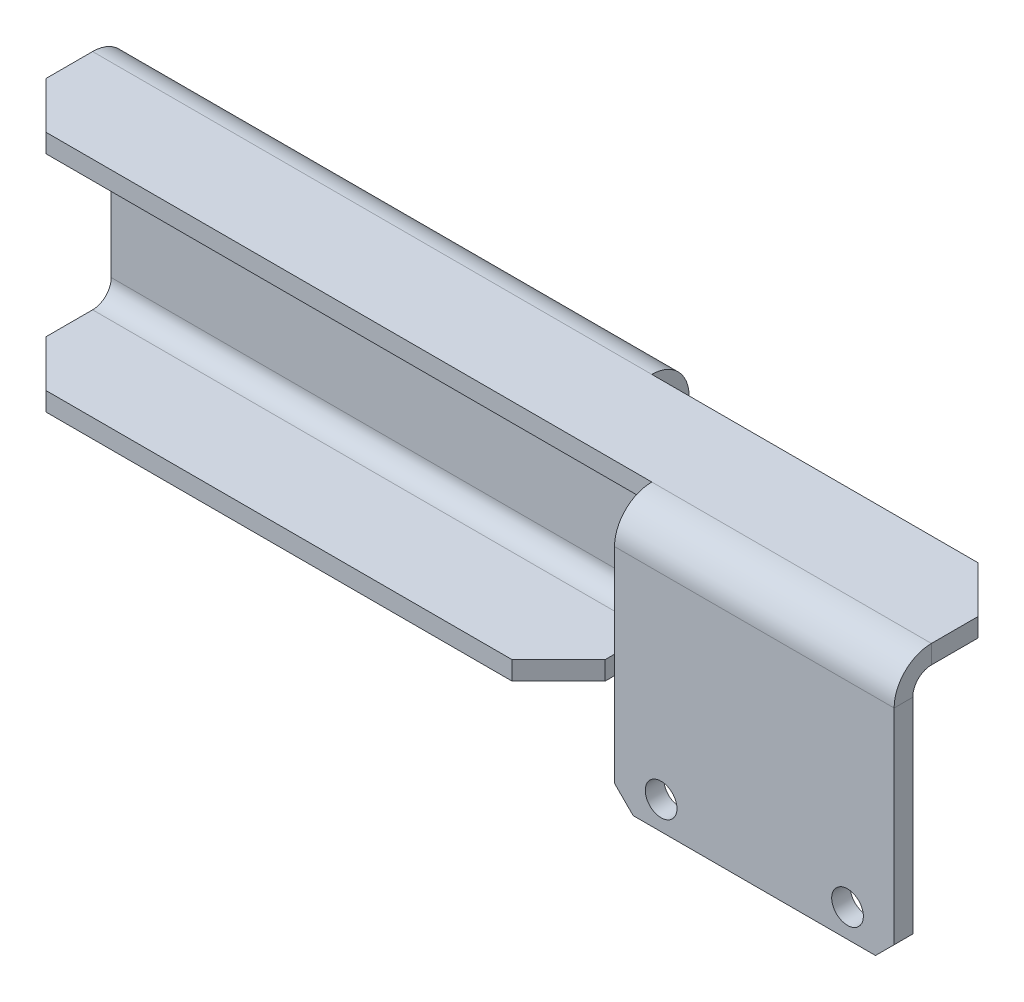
ISO-10303-21;
HEADER;
FILE_DESCRIPTION(('STEP AP214'),'2;1');
FILE_NAME('part.step','',(''),(''),'','','');
FILE_SCHEMA(('AUTOMOTIVE_DESIGN { 1 0 10303 214 1 1 1 1 }'));
ENDSEC;
DATA;
#1=APPLICATION_CONTEXT('core data for automotive mechanical design processes');
#2=APPLICATION_PROTOCOL_DEFINITION('international standard','automotive_design',2000,#1);
#3=PRODUCT_CONTEXT('',#1,'mechanical');
#4=PRODUCT('Part','Part','',(#3));
#5=PRODUCT_RELATED_PRODUCT_CATEGORY('part','',(#4));
#6=PRODUCT_DEFINITION_FORMATION('','',#4);
#7=PRODUCT_DEFINITION_CONTEXT('part definition',#1,'design');
#8=PRODUCT_DEFINITION('design','',#6,#7);
#9=PRODUCT_DEFINITION_SHAPE('','',#8);
#10=(LENGTH_UNIT() NAMED_UNIT(*) SI_UNIT(.MILLI.,.METRE.));
#11=(NAMED_UNIT(*) PLANE_ANGLE_UNIT() SI_UNIT($,.RADIAN.));
#12=(NAMED_UNIT(*) SI_UNIT($,.STERADIAN.) SOLID_ANGLE_UNIT());
#13=UNCERTAINTY_MEASURE_WITH_UNIT(LENGTH_MEASURE(1.E-05),#10,'distance_accuracy_value','');
#14=(GEOMETRIC_REPRESENTATION_CONTEXT(3) GLOBAL_UNCERTAINTY_ASSIGNED_CONTEXT((#13)) GLOBAL_UNIT_ASSIGNED_CONTEXT((#10,
#11,#12)) REPRESENTATION_CONTEXT('',''));
#15=CARTESIAN_POINT('',(0.,0.,0.));
#16=DIRECTION('',(0.,0.,1.));
#17=DIRECTION('',(1.,0.,0.));
#18=AXIS2_PLACEMENT_3D('',#15,#16,#17);
#19=CARTESIAN_POINT('',(0.,0.,2.));
#20=DIRECTION('',(1.,0.,0.));
#21=DIRECTION('',(0.,0.,-1.));
#22=AXIS2_PLACEMENT_3D('',#19,#20,#21);
#23=PLANE('',#22);
#24=DIRECTION('',(0.,0.,-1.));
#25=VECTOR('',#24,1.);
#26=CARTESIAN_POINT('',(0.,3.99999999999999,2.));
#27=LINE('',#26,#25);
#28=CARTESIAN_POINT('',(0.,3.99999999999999,2.));
#29=VERTEX_POINT('',#28);
#30=CARTESIAN_POINT('',(0.,4.00000000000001,0.));
#31=VERTEX_POINT('',#30);
#32=EDGE_CURVE('E478',#29,#31,#27,.T.);
#33=ORIENTED_EDGE('',*,*,#32,.F.);
#34=DIRECTION('',(0.,-1.,0.));
#35=VECTOR('',#34,1.);
#36=CARTESIAN_POINT('',(0.,0.,2.));
#37=LINE('',#36,#35);
#38=CARTESIAN_POINT('',(0.,22.,1.99999999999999));
#39=VERTEX_POINT('',#38);
#40=EDGE_CURVE('E503',#39,#29,#37,.T.);
#41=ORIENTED_EDGE('',*,*,#40,.F.);
#42=DIRECTION('',(0.,0.,-1.));
#43=VECTOR('',#42,1.);
#44=CARTESIAN_POINT('',(0.,22.,1.99999999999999));
#45=LINE('',#44,#43);
#46=CARTESIAN_POINT('',(0.,22.,0.));
#47=VERTEX_POINT('',#46);
#48=EDGE_CURVE('E543',#39,#47,#45,.T.);
#49=ORIENTED_EDGE('',*,*,#48,.T.);
#50=DIRECTION('',(0.,-1.,0.));
#51=VECTOR('',#50,1.);
#52=CARTESIAN_POINT('',(0.,0.,0.));
#53=LINE('',#52,#51);
#54=EDGE_CURVE('E504',#47,#31,#53,.T.);
#55=ORIENTED_EDGE('',*,*,#54,.T.);
#56=EDGE_LOOP('',(#33,#41,#49,#55));
#57=FACE_BOUND('',#56,.T.);
#58=ADVANCED_FACE('F94',(#57),#23,.F.);
#59=CARTESIAN_POINT('',(60.,0.,2.));
#60=DIRECTION('',(-1.,0.,0.));
#61=DIRECTION('',(0.,0.,1.));
#62=AXIS2_PLACEMENT_3D('',#59,#60,#61);
#63=PLANE('',#62);
#64=DIRECTION('',(0.,0.,-1.));
#65=VECTOR('',#64,1.);
#66=CARTESIAN_POINT('',(60.,3.99999999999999,2.));
#67=LINE('',#66,#65);
#68=CARTESIAN_POINT('',(60.,3.99999999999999,2.));
#69=VERTEX_POINT('',#68);
#70=CARTESIAN_POINT('',(60.,3.99999999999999,0.));
#71=VERTEX_POINT('',#70);
#72=EDGE_CURVE('E340',#69,#71,#67,.T.);
#73=ORIENTED_EDGE('',*,*,#72,.T.);
#74=DIRECTION('',(0.,1.,0.));
#75=VECTOR('',#74,1.);
#76=CARTESIAN_POINT('',(60.,0.,0.));
#77=LINE('',#76,#75);
#78=CARTESIAN_POINT('',(60.,22.,0.));
#79=VERTEX_POINT('',#78);
#80=EDGE_CURVE('E493',#71,#79,#77,.T.);
#81=ORIENTED_EDGE('',*,*,#80,.T.);
#82=DIRECTION('',(0.,0.,-1.));
#83=VECTOR('',#82,1.);
#84=CARTESIAN_POINT('',(60.,22.,1.99999999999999));
#85=LINE('',#84,#83);
#86=CARTESIAN_POINT('',(60.,22.,1.99999999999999));
#87=VERTEX_POINT('',#86);
#88=EDGE_CURVE('E508',#87,#79,#85,.T.);
#89=ORIENTED_EDGE('',*,*,#88,.F.);
#90=DIRECTION('',(0.,1.,0.));
#91=VECTOR('',#90,1.);
#92=CARTESIAN_POINT('',(60.,0.,2.));
#93=LINE('',#92,#91);
#94=EDGE_CURVE('E330',#69,#87,#93,.T.);
#95=ORIENTED_EDGE('',*,*,#94,.F.);
#96=EDGE_LOOP('',(#73,#81,#89,#95));
#97=FACE_BOUND('',#96,.T.);
#98=ADVANCED_FACE('F491',(#97),#63,.F.);
#99=CARTESIAN_POINT('',(0.,26.,2.));
#100=DIRECTION('',(0.,0.,-1.));
#101=DIRECTION('',(-1.,0.,0.));
#102=AXIS2_PLACEMENT_3D('',#99,#100,#101);
#103=PLANE('',#102);
#104=DIRECTION('',(1.,0.,0.));
#105=VECTOR('',#104,1.);
#106=CARTESIAN_POINT('',(60.,3.99999999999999,2.));
#107=LINE('',#106,#105);
#108=EDGE_CURVE('E475',#69,#29,#107,.F.);
#109=ORIENTED_EDGE('',*,*,#108,.F.);
#110=ORIENTED_EDGE('',*,*,#94,.T.);
#111=DIRECTION('',(-1.,0.,0.));
#112=VECTOR('',#111,1.);
#113=CARTESIAN_POINT('',(0.,22.,1.99999999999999));
#114=LINE('',#113,#112);
#115=EDGE_CURVE('E549',#39,#87,#114,.F.);
#116=ORIENTED_EDGE('',*,*,#115,.F.);
#117=ORIENTED_EDGE('',*,*,#40,.T.);
#118=EDGE_LOOP('',(#109,#110,#116,#117));
#119=FACE_BOUND('',#118,.T.);
#120=ADVANCED_FACE('F560',(#119),#103,.F.);
#121=CARTESIAN_POINT('',(0.,26.,0.));
#122=DIRECTION('',(0.,0.,-1.));
#123=DIRECTION('',(-1.,0.,0.));
#124=AXIS2_PLACEMENT_3D('',#121,#122,#123);
#125=PLANE('',#124);
#126=ORIENTED_EDGE('',*,*,#80,.F.);
#127=DIRECTION('',(1.,0.,0.));
#128=VECTOR('',#127,1.);
#129=CARTESIAN_POINT('',(60.,3.99999999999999,0.));
#130=LINE('',#129,#128);
#131=EDGE_CURVE('E463',#71,#31,#130,.F.);
#132=ORIENTED_EDGE('',*,*,#131,.T.);
#133=ORIENTED_EDGE('',*,*,#54,.F.);
#134=DIRECTION('',(-1.,0.,0.));
#135=VECTOR('',#134,1.);
#136=CARTESIAN_POINT('',(0.,22.,0.));
#137=LINE('',#136,#135);
#138=EDGE_CURVE('E502',#47,#79,#137,.F.);
#139=ORIENTED_EDGE('',*,*,#138,.T.);
#140=EDGE_LOOP('',(#126,#132,#133,#139));
#141=FACE_BOUND('',#140,.T.);
#142=ADVANCED_FACE('F499',(#141),#125,.T.);
#143=CARTESIAN_POINT('',(60.,22.,4.));
#144=DIRECTION('',(1.,0.,0.));
#145=DIRECTION('',(0.,0.,-1.));
#146=AXIS2_PLACEMENT_3D('',#143,#144,#145);
#147=PLANE('',#146);
#148=DIRECTION('',(0.,-1.,0.));
#149=VECTOR('',#148,1.);
#150=CARTESIAN_POINT('',(60.,26.,3.99999999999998));
#151=LINE('',#150,#149);
#152=CARTESIAN_POINT('',(60.,24.,3.99999999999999));
#153=VERTEX_POINT('',#152);
#154=CARTESIAN_POINT('',(60.,26.,3.99999999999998));
#155=VERTEX_POINT('',#154);
#156=EDGE_CURVE('E480',#153,#155,#151,.F.);
#157=ORIENTED_EDGE('',*,*,#156,.F.);
#158=CARTESIAN_POINT('',(60.,22.,4.));
#159=DIRECTION('',(-1.,0.,0.));
#160=DIRECTION('',(0.,0.,1.));
#161=AXIS2_PLACEMENT_3D('',#158,#159,#160);
#162=CIRCLE('',#161,2.);
#163=EDGE_CURVE('E546',#87,#153,#162,.F.);
#164=ORIENTED_EDGE('',*,*,#163,.F.);
#165=ORIENTED_EDGE('',*,*,#88,.T.);
#166=CARTESIAN_POINT('',(60.,22.,4.));
#167=DIRECTION('',(-1.,0.,0.));
#168=DIRECTION('',(0.,0.,1.));
#169=AXIS2_PLACEMENT_3D('',#166,#167,#168);
#170=CIRCLE('',#169,4.);
#171=EDGE_CURVE('E540',#79,#155,#170,.F.);
#172=ORIENTED_EDGE('',*,*,#171,.T.);
#173=EDGE_LOOP('',(#157,#164,#165,#172));
#174=FACE_BOUND('',#173,.T.);
#175=ADVANCED_FACE('F568',(#174),#147,.T.);
#176=CARTESIAN_POINT('',(0.,22.,4.));
#177=DIRECTION('',(1.,0.,0.));
#178=DIRECTION('',(0.,0.,-1.));
#179=AXIS2_PLACEMENT_3D('',#176,#177,#178);
#180=PLANE('',#179);
#181=CARTESIAN_POINT('',(0.,22.,4.));
#182=DIRECTION('',(-1.,0.,0.));
#183=DIRECTION('',(0.,0.,1.));
#184=AXIS2_PLACEMENT_3D('',#181,#182,#183);
#185=CIRCLE('',#184,2.);
#186=CARTESIAN_POINT('',(0.,24.,3.99999999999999));
#187=VERTEX_POINT('',#186);
#188=EDGE_CURVE('E334',#187,#39,#185,.T.);
#189=ORIENTED_EDGE('',*,*,#188,.F.);
#190=DIRECTION('',(0.,-1.,0.));
#191=VECTOR('',#190,1.);
#192=CARTESIAN_POINT('',(0.,24.,3.99999999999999));
#193=LINE('',#192,#191);
#194=CARTESIAN_POINT('',(0.,26.,3.99999999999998));
#195=VERTEX_POINT('',#194);
#196=EDGE_CURVE('E530',#187,#195,#193,.F.);
#197=ORIENTED_EDGE('',*,*,#196,.T.);
#198=CARTESIAN_POINT('',(0.,22.,4.));
#199=DIRECTION('',(-1.,0.,0.));
#200=DIRECTION('',(0.,0.,1.));
#201=AXIS2_PLACEMENT_3D('',#198,#199,#200);
#202=CIRCLE('',#201,4.);
#203=EDGE_CURVE('E541',#195,#47,#202,.T.);
#204=ORIENTED_EDGE('',*,*,#203,.T.);
#205=ORIENTED_EDGE('',*,*,#48,.F.);
#206=EDGE_LOOP('',(#189,#197,#204,#205));
#207=FACE_BOUND('',#206,.T.);
#208=ADVANCED_FACE('F602',(#207),#180,.F.);
#209=CARTESIAN_POINT('',(0.,22.,4.));
#210=DIRECTION('',(-1.,0.,0.));
#211=DIRECTION('',(0.,1.,0.));
#212=AXIS2_PLACEMENT_3D('',#209,#210,#211);
#213=CYLINDRICAL_SURFACE('',#212,4.);
#214=ORIENTED_EDGE('',*,*,#138,.F.);
#215=ORIENTED_EDGE('',*,*,#203,.F.);
#216=DIRECTION('',(-1.,0.,0.));
#217=VECTOR('',#216,1.);
#218=CARTESIAN_POINT('',(60.,26.,3.99999999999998));
#219=LINE('',#218,#217);
#220=EDGE_CURVE('E531',#195,#155,#219,.F.);
#221=ORIENTED_EDGE('',*,*,#220,.T.);
#222=ORIENTED_EDGE('',*,*,#171,.F.);
#223=EDGE_LOOP('',(#214,#215,#221,#222));
#224=FACE_BOUND('',#223,.T.);
#225=ADVANCED_FACE('F605',(#224),#213,.T.);
#226=CARTESIAN_POINT('',(0.,22.,4.));
#227=DIRECTION('',(-1.,0.,0.));
#228=DIRECTION('',(0.,1.,0.));
#229=AXIS2_PLACEMENT_3D('',#226,#227,#228);
#230=CYLINDRICAL_SURFACE('',#229,2.);
#231=ORIENTED_EDGE('',*,*,#115,.T.);
#232=ORIENTED_EDGE('',*,*,#163,.T.);
#233=DIRECTION('',(-1.,0.,0.));
#234=VECTOR('',#233,1.);
#235=CARTESIAN_POINT('',(60.,24.,3.99999999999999));
#236=LINE('',#235,#234);
#237=EDGE_CURVE('E485',#153,#187,#236,.T.);
#238=ORIENTED_EDGE('',*,*,#237,.T.);
#239=ORIENTED_EDGE('',*,*,#188,.T.);
#240=EDGE_LOOP('',(#231,#232,#238,#239));
#241=FACE_BOUND('',#240,.T.);
#242=ADVANCED_FACE('F564',(#241),#230,.F.);
#243=CARTESIAN_POINT('',(0.,26.,14.));
#244=DIRECTION('',(1.,0.,0.));
#245=DIRECTION('',(0.,0.,-1.));
#246=AXIS2_PLACEMENT_3D('',#243,#244,#245);
#247=PLANE('',#246);
#248=DIRECTION('',(0.,0.,-1.));
#249=VECTOR('',#248,1.);
#250=CARTESIAN_POINT('',(0.,24.,14.));
#251=LINE('',#250,#249);
#252=CARTESIAN_POINT('',(0.,24.,8.99999999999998));
#253=VERTEX_POINT('',#252);
#254=EDGE_CURVE('E347',#187,#253,#251,.F.);
#255=ORIENTED_EDGE('',*,*,#254,.T.);
#256=DIRECTION('',(0.,1.,0.));
#257=VECTOR('',#256,1.);
#258=CARTESIAN_POINT('',(0.,26.,8.99999999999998));
#259=LINE('',#258,#257);
#260=CARTESIAN_POINT('',(0.,26.,8.99999999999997));
#261=VERTEX_POINT('',#260);
#262=EDGE_CURVE('E378',#253,#261,#259,.T.);
#263=ORIENTED_EDGE('',*,*,#262,.T.);
#264=DIRECTION('',(0.,0.,1.));
#265=VECTOR('',#264,1.);
#266=CARTESIAN_POINT('',(0.,26.,14.));
#267=LINE('',#266,#265);
#268=EDGE_CURVE('E335',#195,#261,#267,.T.);
#269=ORIENTED_EDGE('',*,*,#268,.F.);
#270=ORIENTED_EDGE('',*,*,#196,.F.);
#271=EDGE_LOOP('',(#255,#263,#269,#270));
#272=FACE_BOUND('',#271,.T.);
#273=ADVANCED_FACE('F527',(#272),#247,.F.);
#274=CARTESIAN_POINT('',(60.,26.,14.));
#275=DIRECTION('',(0.,-1.,0.));
#276=DIRECTION('',(0.,0.,-1.));
#277=AXIS2_PLACEMENT_3D('',#274,#275,#276);
#278=PLANE('',#277);
#279=DIRECTION('',(0.,0.,1.));
#280=VECTOR('',#279,1.);
#281=CARTESIAN_POINT('',(100.,26.,14.));
#282=LINE('',#281,#280);
#283=CARTESIAN_POINT('',(100.,26.,8.99999999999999));
#284=VERTEX_POINT('',#283);
#285=CARTESIAN_POINT('',(100.,26.,14.));
#286=VERTEX_POINT('',#285);
#287=EDGE_CURVE('E425',#284,#286,#282,.T.);
#288=ORIENTED_EDGE('',*,*,#287,.F.);
#289=DIRECTION('',(-0.707106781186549,0.,-0.707106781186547));
#290=VECTOR('',#289,1.);
#291=CARTESIAN_POINT('',(100.,26.,8.99999999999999));
#292=LINE('',#291,#290);
#293=CARTESIAN_POINT('',(95.,26.,3.99999999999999));
#294=VERTEX_POINT('',#293);
#295=EDGE_CURVE('E575',#284,#294,#292,.T.);
#296=ORIENTED_EDGE('',*,*,#295,.T.);
#297=DIRECTION('',(-1.,0.,0.));
#298=VECTOR('',#297,1.);
#299=CARTESIAN_POINT('',(100.,26.,3.99999999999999));
#300=LINE('',#299,#298);
#301=EDGE_CURVE('E429',#294,#155,#300,.T.);
#302=ORIENTED_EDGE('',*,*,#301,.T.);
#303=ORIENTED_EDGE('',*,*,#220,.F.);
#304=ORIENTED_EDGE('',*,*,#268,.T.);
#305=DIRECTION('',(-0.707106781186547,0.,-0.707106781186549));
#306=VECTOR('',#305,1.);
#307=CARTESIAN_POINT('',(5.,26.,14.));
#308=LINE('',#307,#306);
#309=CARTESIAN_POINT('',(5.00000000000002,26.,14.));
#310=VERTEX_POINT('',#309);
#311=EDGE_CURVE('E329',#261,#310,#308,.F.);
#312=ORIENTED_EDGE('',*,*,#311,.T.);
#313=DIRECTION('',(1.,0.,0.));
#314=VECTOR('',#313,1.);
#315=CARTESIAN_POINT('',(60.,26.,14.));
#316=LINE('',#315,#314);
#317=CARTESIAN_POINT('',(70.,26.,14.));
#318=VERTEX_POINT('',#317);
#319=EDGE_CURVE('E331',#310,#318,#316,.T.);
#320=ORIENTED_EDGE('',*,*,#319,.T.);
#321=DIRECTION('',(-1.,0.,0.));
#322=VECTOR('',#321,1.);
#323=CARTESIAN_POINT('',(70.,26.,14.));
#324=LINE('',#323,#322);
#325=EDGE_CURVE('E267',#318,#286,#324,.F.);
#326=ORIENTED_EDGE('',*,*,#325,.T.);
#327=EDGE_LOOP('',(#288,#296,#302,#303,#304,#312,#320,#326));
#328=FACE_BOUND('',#327,.T.);
#329=ADVANCED_FACE('F513',(#328),#278,.F.);
#330=CARTESIAN_POINT('',(60.,24.,14.));
#331=DIRECTION('',(0.,-1.,0.));
#332=DIRECTION('',(0.,0.,-1.));
#333=AXIS2_PLACEMENT_3D('',#330,#331,#332);
#334=PLANE('',#333);
#335=DIRECTION('',(-1.,0.,0.));
#336=VECTOR('',#335,1.);
#337=CARTESIAN_POINT('',(100.,24.,3.99999999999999));
#338=LINE('',#337,#336);
#339=CARTESIAN_POINT('',(95.,24.,3.99999999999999));
#340=VERTEX_POINT('',#339);
#341=EDGE_CURVE('E431',#340,#153,#338,.T.);
#342=ORIENTED_EDGE('',*,*,#341,.F.);
#343=DIRECTION('',(0.707106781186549,0.,0.707106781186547));
#344=VECTOR('',#343,1.);
#345=CARTESIAN_POINT('',(82.4999999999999,24.,-8.50000000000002));
#346=LINE('',#345,#344);
#347=CARTESIAN_POINT('',(100.,24.,9.));
#348=VERTEX_POINT('',#347);
#349=EDGE_CURVE('E355',#340,#348,#346,.T.);
#350=ORIENTED_EDGE('',*,*,#349,.T.);
#351=DIRECTION('',(0.,0.,-1.));
#352=VECTOR('',#351,1.);
#353=CARTESIAN_POINT('',(100.,24.,14.));
#354=LINE('',#353,#352);
#355=CARTESIAN_POINT('',(100.,24.,14.));
#356=VERTEX_POINT('',#355);
#357=EDGE_CURVE('E418',#356,#348,#354,.T.);
#358=ORIENTED_EDGE('',*,*,#357,.F.);
#359=DIRECTION('',(-1.,0.,0.));
#360=VECTOR('',#359,1.);
#361=CARTESIAN_POINT('',(70.,24.,14.));
#362=LINE('',#361,#360);
#363=CARTESIAN_POINT('',(70.,24.,14.));
#364=VERTEX_POINT('',#363);
#365=EDGE_CURVE('E310',#364,#356,#362,.F.);
#366=ORIENTED_EDGE('',*,*,#365,.F.);
#367=DIRECTION('',(-1.,0.,0.));
#368=VECTOR('',#367,1.);
#369=CARTESIAN_POINT('',(60.,24.,14.));
#370=LINE('',#369,#368);
#371=CARTESIAN_POINT('',(5.,24.,14.));
#372=VERTEX_POINT('',#371);
#373=EDGE_CURVE('E344',#372,#364,#370,.F.);
#374=ORIENTED_EDGE('',*,*,#373,.F.);
#375=DIRECTION('',(0.707106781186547,0.,0.707106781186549));
#376=VECTOR('',#375,1.);
#377=CARTESIAN_POINT('',(32.4999999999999,24.0000000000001,41.5));
#378=LINE('',#377,#376);
#379=EDGE_CURVE('E353',#372,#253,#378,.F.);
#380=ORIENTED_EDGE('',*,*,#379,.T.);
#381=ORIENTED_EDGE('',*,*,#254,.F.);
#382=ORIENTED_EDGE('',*,*,#237,.F.);
#383=EDGE_LOOP('',(#342,#350,#358,#366,#374,#380,#381,#382));
#384=FACE_BOUND('',#383,.T.);
#385=ADVANCED_FACE('F420',(#384),#334,.T.);
#386=CARTESIAN_POINT('',(60.,26.,14.));
#387=DIRECTION('',(0.,0.,-1.));
#388=DIRECTION('',(0.,1.,0.));
#389=AXIS2_PLACEMENT_3D('',#386,#387,#388);
#390=PLANE('',#389);
#391=ORIENTED_EDGE('',*,*,#319,.F.);
#392=DIRECTION('',(0.,-1.,0.));
#393=VECTOR('',#392,1.);
#394=CARTESIAN_POINT('',(5.,26.,14.));
#395=LINE('',#394,#393);
#396=EDGE_CURVE('E375',#310,#372,#395,.T.);
#397=ORIENTED_EDGE('',*,*,#396,.T.);
#398=ORIENTED_EDGE('',*,*,#373,.T.);
#399=DIRECTION('',(0.,1.,0.));
#400=VECTOR('',#399,1.);
#401=CARTESIAN_POINT('',(70.,24.,14.));
#402=LINE('',#401,#400);
#403=EDGE_CURVE('E307',#364,#318,#402,.T.);
#404=ORIENTED_EDGE('',*,*,#403,.T.);
#405=EDGE_LOOP('',(#391,#397,#398,#404));
#406=FACE_BOUND('',#405,.T.);
#407=ADVANCED_FACE('F518',(#406),#390,.F.);
#408=CARTESIAN_POINT('',(0.,3.99999999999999,4.));
#409=DIRECTION('',(-1.,0.,0.));
#410=DIRECTION('',(0.,0.,1.));
#411=AXIS2_PLACEMENT_3D('',#408,#409,#410);
#412=PLANE('',#411);
#413=DIRECTION('',(0.,1.,0.));
#414=VECTOR('',#413,1.);
#415=CARTESIAN_POINT('',(0.,0.,3.99999999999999));
#416=LINE('',#415,#414);
#417=CARTESIAN_POINT('',(0.,1.99999999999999,3.99999999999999));
#418=VERTEX_POINT('',#417);
#419=CARTESIAN_POINT('',(0.,0.,3.99999999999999));
#420=VERTEX_POINT('',#419);
#421=EDGE_CURVE('E435',#418,#420,#416,.F.);
#422=ORIENTED_EDGE('',*,*,#421,.F.);
#423=CARTESIAN_POINT('',(0.,3.99999999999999,4.));
#424=DIRECTION('',(1.,0.,0.));
#425=DIRECTION('',(0.,0.,-1.));
#426=AXIS2_PLACEMENT_3D('',#423,#424,#425);
#427=CIRCLE('',#426,2.);
#428=EDGE_CURVE('E472',#29,#418,#427,.F.);
#429=ORIENTED_EDGE('',*,*,#428,.F.);
#430=ORIENTED_EDGE('',*,*,#32,.T.);
#431=CARTESIAN_POINT('',(0.,3.99999999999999,4.));
#432=DIRECTION('',(1.,0.,0.));
#433=DIRECTION('',(0.,0.,-1.));
#434=AXIS2_PLACEMENT_3D('',#431,#432,#433);
#435=CIRCLE('',#434,4.);
#436=EDGE_CURVE('E466',#31,#420,#435,.F.);
#437=ORIENTED_EDGE('',*,*,#436,.T.);
#438=EDGE_LOOP('',(#422,#429,#430,#437));
#439=FACE_BOUND('',#438,.T.);
#440=ADVANCED_FACE('F617',(#439),#412,.T.);
#441=CARTESIAN_POINT('',(60.,3.99999999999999,4.));
#442=DIRECTION('',(-1.,0.,0.));
#443=DIRECTION('',(0.,0.,1.));
#444=AXIS2_PLACEMENT_3D('',#441,#442,#443);
#445=PLANE('',#444);
#446=CARTESIAN_POINT('',(60.,3.99999999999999,4.));
#447=DIRECTION('',(1.,0.,0.));
#448=DIRECTION('',(0.,0.,-1.));
#449=AXIS2_PLACEMENT_3D('',#446,#447,#448);
#450=CIRCLE('',#449,2.);
#451=CARTESIAN_POINT('',(60.,1.99999999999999,3.99999999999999));
#452=VERTEX_POINT('',#451);
#453=EDGE_CURVE('E439',#452,#69,#450,.T.);
#454=ORIENTED_EDGE('',*,*,#453,.F.);
#455=DIRECTION('',(0.,1.,0.));
#456=VECTOR('',#455,1.);
#457=CARTESIAN_POINT('',(60.,1.99999999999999,3.99999999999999));
#458=LINE('',#457,#456);
#459=CARTESIAN_POINT('',(60.,0.,3.99999999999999));
#460=VERTEX_POINT('',#459);
#461=EDGE_CURVE('E456',#452,#460,#458,.F.);
#462=ORIENTED_EDGE('',*,*,#461,.T.);
#463=CARTESIAN_POINT('',(60.,3.99999999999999,4.));
#464=DIRECTION('',(1.,0.,0.));
#465=DIRECTION('',(0.,0.,-1.));
#466=AXIS2_PLACEMENT_3D('',#463,#464,#465);
#467=CIRCLE('',#466,4.);
#468=EDGE_CURVE('E467',#460,#71,#467,.T.);
#469=ORIENTED_EDGE('',*,*,#468,.T.);
#470=ORIENTED_EDGE('',*,*,#72,.F.);
#471=EDGE_LOOP('',(#454,#462,#469,#470));
#472=FACE_BOUND('',#471,.T.);
#473=ADVANCED_FACE('F622',(#472),#445,.F.);
#474=CARTESIAN_POINT('',(60.,3.99999999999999,4.));
#475=DIRECTION('',(1.,0.,0.));
#476=DIRECTION('',(0.,-1.,0.));
#477=AXIS2_PLACEMENT_3D('',#474,#475,#476);
#478=CYLINDRICAL_SURFACE('',#477,4.);
#479=ORIENTED_EDGE('',*,*,#131,.F.);
#480=ORIENTED_EDGE('',*,*,#468,.F.);
#481=DIRECTION('',(1.,0.,0.));
#482=VECTOR('',#481,1.);
#483=CARTESIAN_POINT('',(0.,0.,3.99999999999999));
#484=LINE('',#483,#482);
#485=EDGE_CURVE('E453',#460,#420,#484,.F.);
#486=ORIENTED_EDGE('',*,*,#485,.T.);
#487=ORIENTED_EDGE('',*,*,#436,.F.);
#488=EDGE_LOOP('',(#479,#480,#486,#487));
#489=FACE_BOUND('',#488,.T.);
#490=ADVANCED_FACE('F625',(#489),#478,.T.);
#491=CARTESIAN_POINT('',(60.,3.99999999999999,4.));
#492=DIRECTION('',(1.,0.,0.));
#493=DIRECTION('',(0.,-1.,0.));
#494=AXIS2_PLACEMENT_3D('',#491,#492,#493);
#495=CYLINDRICAL_SURFACE('',#494,2.);
#496=ORIENTED_EDGE('',*,*,#108,.T.);
#497=ORIENTED_EDGE('',*,*,#428,.T.);
#498=DIRECTION('',(1.,0.,0.));
#499=VECTOR('',#498,1.);
#500=CARTESIAN_POINT('',(0.,1.99999999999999,3.99999999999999));
#501=LINE('',#500,#499);
#502=EDGE_CURVE('E459',#418,#452,#501,.T.);
#503=ORIENTED_EDGE('',*,*,#502,.T.);
#504=ORIENTED_EDGE('',*,*,#453,.T.);
#505=EDGE_LOOP('',(#496,#497,#503,#504));
#506=FACE_BOUND('',#505,.T.);
#507=ADVANCED_FACE('F626',(#506),#495,.F.);
#508=CARTESIAN_POINT('',(0.,0.,1.99999999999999));
#509=DIRECTION('',(1.,0.,0.));
#510=DIRECTION('',(0.,0.,-1.));
#511=AXIS2_PLACEMENT_3D('',#508,#509,#510);
#512=PLANE('',#511);
#513=DIRECTION('',(0.,0.,-1.));
#514=VECTOR('',#513,1.);
#515=CARTESIAN_POINT('',(0.,0.,14.));
#516=LINE('',#515,#514);
#517=CARTESIAN_POINT('',(0.,0.,8.99999999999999));
#518=VERTEX_POINT('',#517);
#519=EDGE_CURVE('E443',#518,#420,#516,.T.);
#520=ORIENTED_EDGE('',*,*,#519,.F.);
#521=DIRECTION('',(0.,1.,0.));
#522=VECTOR('',#521,1.);
#523=CARTESIAN_POINT('',(0.,0.,8.99999999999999));
#524=LINE('',#523,#522);
#525=CARTESIAN_POINT('',(0.,1.99999999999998,8.99999999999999));
#526=VERTEX_POINT('',#525);
#527=EDGE_CURVE('E372',#518,#526,#524,.T.);
#528=ORIENTED_EDGE('',*,*,#527,.T.);
#529=DIRECTION('',(0.,0.,1.));
#530=VECTOR('',#529,1.);
#531=CARTESIAN_POINT('',(0.,2.,2.));
#532=LINE('',#531,#530);
#533=EDGE_CURVE('E451',#526,#418,#532,.F.);
#534=ORIENTED_EDGE('',*,*,#533,.T.);
#535=ORIENTED_EDGE('',*,*,#421,.T.);
#536=EDGE_LOOP('',(#520,#528,#534,#535));
#537=FACE_BOUND('',#536,.T.);
#538=ADVANCED_FACE('F631',(#537),#512,.F.);
#539=CARTESIAN_POINT('',(60.,0.,14.));
#540=DIRECTION('',(-1.,0.,0.));
#541=DIRECTION('',(0.,0.,1.));
#542=AXIS2_PLACEMENT_3D('',#539,#540,#541);
#543=PLANE('',#542);
#544=DIRECTION('',(0.,0.,-1.));
#545=VECTOR('',#544,1.);
#546=CARTESIAN_POINT('',(60.,1.99999999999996,14.));
#547=LINE('',#546,#545);
#548=CARTESIAN_POINT('',(60.,1.99999999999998,8.99999999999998));
#549=VERTEX_POINT('',#548);
#550=EDGE_CURVE('E448',#452,#549,#547,.F.);
#551=ORIENTED_EDGE('',*,*,#550,.T.);
#552=DIRECTION('',(0.,-1.,0.));
#553=VECTOR('',#552,1.);
#554=CARTESIAN_POINT('',(60.,0.,8.99999999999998));
#555=LINE('',#554,#553);
#556=CARTESIAN_POINT('',(60.,0.,8.99999999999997));
#557=VERTEX_POINT('',#556);
#558=EDGE_CURVE('E366',#549,#557,#555,.T.);
#559=ORIENTED_EDGE('',*,*,#558,.T.);
#560=DIRECTION('',(0.,0.,1.));
#561=VECTOR('',#560,1.);
#562=CARTESIAN_POINT('',(60.,0.,14.));
#563=LINE('',#562,#561);
#564=EDGE_CURVE('E440',#460,#557,#563,.T.);
#565=ORIENTED_EDGE('',*,*,#564,.F.);
#566=ORIENTED_EDGE('',*,*,#461,.F.);
#567=EDGE_LOOP('',(#551,#559,#565,#566));
#568=FACE_BOUND('',#567,.T.);
#569=ADVANCED_FACE('F638',(#568),#543,.F.);
#570=CARTESIAN_POINT('',(0.,0.,14.));
#571=DIRECTION('',(0.,1.,0.));
#572=DIRECTION('',(0.,0.,1.));
#573=AXIS2_PLACEMENT_3D('',#570,#571,#572);
#574=PLANE('',#573);
#575=ORIENTED_EDGE('',*,*,#564,.T.);
#576=DIRECTION('',(0.707106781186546,0.,-0.70710678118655));
#577=VECTOR('',#576,1.);
#578=CARTESIAN_POINT('',(55.,0.,14.));
#579=LINE('',#578,#577);
#580=CARTESIAN_POINT('',(55.,0.,14.));
#581=VERTEX_POINT('',#580);
#582=EDGE_CURVE('E370',#557,#581,#579,.F.);
#583=ORIENTED_EDGE('',*,*,#582,.T.);
#584=DIRECTION('',(-1.,0.,0.));
#585=VECTOR('',#584,1.);
#586=CARTESIAN_POINT('',(0.,0.,14.));
#587=LINE('',#586,#585);
#588=CARTESIAN_POINT('',(5.00000000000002,0.,14.));
#589=VERTEX_POINT('',#588);
#590=EDGE_CURVE('E436',#581,#589,#587,.T.);
#591=ORIENTED_EDGE('',*,*,#590,.T.);
#592=DIRECTION('',(0.707106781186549,0.,0.707106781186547));
#593=VECTOR('',#592,1.);
#594=CARTESIAN_POINT('',(0.,0.,8.99999999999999));
#595=LINE('',#594,#593);
#596=EDGE_CURVE('E368',#589,#518,#595,.F.);
#597=ORIENTED_EDGE('',*,*,#596,.T.);
#598=ORIENTED_EDGE('',*,*,#519,.T.);
#599=ORIENTED_EDGE('',*,*,#485,.F.);
#600=EDGE_LOOP('',(#575,#583,#591,#597,#598,#599));
#601=FACE_BOUND('',#600,.T.);
#602=ADVANCED_FACE('F642',(#601),#574,.F.);
#603=CARTESIAN_POINT('',(0.,1.99999999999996,14.));
#604=DIRECTION('',(0.,1.,0.));
#605=DIRECTION('',(0.,0.,1.));
#606=AXIS2_PLACEMENT_3D('',#603,#604,#605);
#607=PLANE('',#606);
#608=DIRECTION('',(1.,0.,0.));
#609=VECTOR('',#608,1.);
#610=CARTESIAN_POINT('',(0.,1.99999999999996,14.));
#611=LINE('',#610,#609);
#612=CARTESIAN_POINT('',(55.,1.99999999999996,14.));
#613=VERTEX_POINT('',#612);
#614=CARTESIAN_POINT('',(5.00000000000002,1.99999999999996,14.));
#615=VERTEX_POINT('',#614);
#616=EDGE_CURVE('E445',#613,#615,#611,.F.);
#617=ORIENTED_EDGE('',*,*,#616,.F.);
#618=DIRECTION('',(-0.707106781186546,0.,0.70710678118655));
#619=VECTOR('',#618,1.);
#620=CARTESIAN_POINT('',(27.5000000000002,1.99999999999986,41.5));
#621=LINE('',#620,#619);
#622=EDGE_CURVE('E364',#613,#549,#621,.F.);
#623=ORIENTED_EDGE('',*,*,#622,.T.);
#624=ORIENTED_EDGE('',*,*,#550,.F.);
#625=ORIENTED_EDGE('',*,*,#502,.F.);
#626=ORIENTED_EDGE('',*,*,#533,.F.);
#627=DIRECTION('',(-0.707106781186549,0.,-0.707106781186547));
#628=VECTOR('',#627,1.);
#629=CARTESIAN_POINT('',(2.5,1.99999999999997,11.5));
#630=LINE('',#629,#628);
#631=EDGE_CURVE('E362',#526,#615,#630,.F.);
#632=ORIENTED_EDGE('',*,*,#631,.T.);
#633=EDGE_LOOP('',(#617,#623,#624,#625,#626,#632));
#634=FACE_BOUND('',#633,.T.);
#635=ADVANCED_FACE('F647',(#634),#607,.T.);
#636=CARTESIAN_POINT('',(0.,0.,14.));
#637=DIRECTION('',(0.,0.,-1.));
#638=DIRECTION('',(0.,1.,0.));
#639=AXIS2_PLACEMENT_3D('',#636,#637,#638);
#640=PLANE('',#639);
#641=ORIENTED_EDGE('',*,*,#590,.F.);
#642=DIRECTION('',(0.,1.,0.));
#643=VECTOR('',#642,1.);
#644=CARTESIAN_POINT('',(55.,0.,14.));
#645=LINE('',#644,#643);
#646=EDGE_CURVE('E359',#581,#613,#645,.T.);
#647=ORIENTED_EDGE('',*,*,#646,.T.);
#648=ORIENTED_EDGE('',*,*,#616,.T.);
#649=DIRECTION('',(0.,-1.,0.));
#650=VECTOR('',#649,1.);
#651=CARTESIAN_POINT('',(5.00000000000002,0.,14.));
#652=LINE('',#651,#650);
#653=EDGE_CURVE('E357',#615,#589,#652,.T.);
#654=ORIENTED_EDGE('',*,*,#653,.T.);
#655=EDGE_LOOP('',(#641,#647,#648,#654));
#656=FACE_BOUND('',#655,.T.);
#657=ADVANCED_FACE('F644',(#656),#640,.F.);
#658=CARTESIAN_POINT('',(100.,26.,3.99999999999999));
#659=DIRECTION('',(0.,0.,1.));
#660=DIRECTION('',(1.,0.,0.));
#661=AXIS2_PLACEMENT_3D('',#658,#659,#660);
#662=PLANE('',#661);
#663=ORIENTED_EDGE('',*,*,#301,.F.);
#664=DIRECTION('',(0.,-1.,0.));
#665=VECTOR('',#664,1.);
#666=CARTESIAN_POINT('',(95.,24.,3.99999999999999));
#667=LINE('',#666,#665);
#668=EDGE_CURVE('E352',#294,#340,#667,.T.);
#669=ORIENTED_EDGE('',*,*,#668,.T.);
#670=ORIENTED_EDGE('',*,*,#341,.T.);
#671=ORIENTED_EDGE('',*,*,#156,.T.);
#672=EDGE_LOOP('',(#663,#669,#670,#671));
#673=FACE_BOUND('',#672,.T.);
#674=ADVANCED_FACE('F571',(#673),#662,.F.);
#675=CARTESIAN_POINT('',(100.,24.,14.));
#676=DIRECTION('',(1.,0.,0.));
#677=DIRECTION('',(0.,0.,-1.));
#678=AXIS2_PLACEMENT_3D('',#675,#676,#677);
#679=PLANE('',#678);
#680=ORIENTED_EDGE('',*,*,#357,.T.);
#681=DIRECTION('',(0.,1.,0.));
#682=VECTOR('',#681,1.);
#683=CARTESIAN_POINT('',(100.,26.,8.99999999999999));
#684=LINE('',#683,#682);
#685=EDGE_CURVE('E326',#348,#284,#684,.T.);
#686=ORIENTED_EDGE('',*,*,#685,.T.);
#687=ORIENTED_EDGE('',*,*,#287,.T.);
#688=DIRECTION('',(0.,-1.,0.));
#689=VECTOR('',#688,1.);
#690=CARTESIAN_POINT('',(100.,26.,14.));
#691=LINE('',#690,#689);
#692=EDGE_CURVE('E313',#286,#356,#691,.T.);
#693=ORIENTED_EDGE('',*,*,#692,.T.);
#694=EDGE_LOOP('',(#680,#686,#687,#693));
#695=FACE_BOUND('',#694,.T.);
#696=ADVANCED_FACE('F426',(#695),#679,.T.);
#697=CARTESIAN_POINT('',(100.,22.,14.));
#698=DIRECTION('',(1.,0.,0.));
#699=DIRECTION('',(0.,0.,-1.));
#700=AXIS2_PLACEMENT_3D('',#697,#698,#699);
#701=PLANE('',#700);
#702=DIRECTION('',(0.,0.,-1.));
#703=VECTOR('',#702,1.);
#704=CARTESIAN_POINT('',(100.,22.,18.));
#705=LINE('',#704,#703);
#706=CARTESIAN_POINT('',(100.,22.,16.));
#707=VERTEX_POINT('',#706);
#708=CARTESIAN_POINT('',(100.,22.0000000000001,18.));
#709=VERTEX_POINT('',#708);
#710=EDGE_CURVE('E301',#707,#709,#705,.F.);
#711=ORIENTED_EDGE('',*,*,#710,.F.);
#712=CARTESIAN_POINT('',(100.,22.,14.));
#713=DIRECTION('',(-1.,0.,0.));
#714=DIRECTION('',(0.,0.,1.));
#715=AXIS2_PLACEMENT_3D('',#712,#713,#714);
#716=CIRCLE('',#715,2.);
#717=EDGE_CURVE('E271',#356,#707,#716,.F.);
#718=ORIENTED_EDGE('',*,*,#717,.F.);
#719=ORIENTED_EDGE('',*,*,#692,.F.);
#720=CARTESIAN_POINT('',(100.,22.,14.));
#721=DIRECTION('',(-1.,0.,0.));
#722=DIRECTION('',(0.,0.,1.));
#723=AXIS2_PLACEMENT_3D('',#720,#721,#722);
#724=CIRCLE('',#723,4.);
#725=EDGE_CURVE('E305',#286,#709,#724,.F.);
#726=ORIENTED_EDGE('',*,*,#725,.T.);
#727=EDGE_LOOP('',(#711,#718,#719,#726));
#728=FACE_BOUND('',#727,.T.);
#729=ADVANCED_FACE('F414',(#728),#701,.T.);
#730=CARTESIAN_POINT('',(70.,22.,14.));
#731=DIRECTION('',(1.,0.,0.));
#732=DIRECTION('',(0.,0.,-1.));
#733=AXIS2_PLACEMENT_3D('',#730,#731,#732);
#734=PLANE('',#733);
#735=CARTESIAN_POINT('',(70.,22.,14.));
#736=DIRECTION('',(-1.,0.,0.));
#737=DIRECTION('',(0.,0.,1.));
#738=AXIS2_PLACEMENT_3D('',#735,#736,#737);
#739=CIRCLE('',#738,2.);
#740=CARTESIAN_POINT('',(70.,22.,16.));
#741=VERTEX_POINT('',#740);
#742=EDGE_CURVE('E278',#741,#364,#739,.T.);
#743=ORIENTED_EDGE('',*,*,#742,.F.);
#744=DIRECTION('',(0.,0.,-1.));
#745=VECTOR('',#744,1.);
#746=CARTESIAN_POINT('',(70.,22.,16.));
#747=LINE('',#746,#745);
#748=CARTESIAN_POINT('',(70.,22.,18.));
#749=VERTEX_POINT('',#748);
#750=EDGE_CURVE('E275',#741,#749,#747,.F.);
#751=ORIENTED_EDGE('',*,*,#750,.T.);
#752=CARTESIAN_POINT('',(70.,22.,14.));
#753=DIRECTION('',(-1.,0.,0.));
#754=DIRECTION('',(0.,0.,1.));
#755=AXIS2_PLACEMENT_3D('',#752,#753,#754);
#756=CIRCLE('',#755,4.);
#757=EDGE_CURVE('E259',#749,#318,#756,.T.);
#758=ORIENTED_EDGE('',*,*,#757,.T.);
#759=ORIENTED_EDGE('',*,*,#403,.F.);
#760=EDGE_LOOP('',(#743,#751,#758,#759));
#761=FACE_BOUND('',#760,.T.);
#762=ADVANCED_FACE('F276',(#761),#734,.F.);
#763=CARTESIAN_POINT('',(70.,22.,14.));
#764=DIRECTION('',(-1.,0.,0.));
#765=DIRECTION('',(0.,0.,1.));
#766=AXIS2_PLACEMENT_3D('',#763,#764,#765);
#767=CYLINDRICAL_SURFACE('',#766,4.);
#768=ORIENTED_EDGE('',*,*,#325,.F.);
#769=ORIENTED_EDGE('',*,*,#757,.F.);
#770=DIRECTION('',(-1.,0.,0.));
#771=VECTOR('',#770,1.);
#772=CARTESIAN_POINT('',(100.,22.,18.));
#773=LINE('',#772,#771);
#774=EDGE_CURVE('E264',#749,#709,#773,.F.);
#775=ORIENTED_EDGE('',*,*,#774,.T.);
#776=ORIENTED_EDGE('',*,*,#725,.F.);
#777=EDGE_LOOP('',(#768,#769,#775,#776));
#778=FACE_BOUND('',#777,.T.);
#779=ADVANCED_FACE('F261',(#778),#767,.T.);
#780=CARTESIAN_POINT('',(70.,22.,14.));
#781=DIRECTION('',(-1.,0.,0.));
#782=DIRECTION('',(0.,0.,1.));
#783=AXIS2_PLACEMENT_3D('',#780,#781,#782);
#784=CYLINDRICAL_SURFACE('',#783,2.);
#785=ORIENTED_EDGE('',*,*,#365,.T.);
#786=ORIENTED_EDGE('',*,*,#717,.T.);
#787=DIRECTION('',(-1.,0.,0.));
#788=VECTOR('',#787,1.);
#789=CARTESIAN_POINT('',(100.,22.,16.));
#790=LINE('',#789,#788);
#791=EDGE_CURVE('E280',#707,#741,#790,.T.);
#792=ORIENTED_EDGE('',*,*,#791,.T.);
#793=ORIENTED_EDGE('',*,*,#742,.T.);
#794=EDGE_LOOP('',(#785,#786,#792,#793));
#795=FACE_BOUND('',#794,.T.);
#796=ADVANCED_FACE('F408',(#795),#784,.F.);
#797=CARTESIAN_POINT('',(70.,-1.99999999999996,18.0000000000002));
#798=DIRECTION('',(1.,0.,0.));
#799=DIRECTION('',(0.,1.,0.));
#800=AXIS2_PLACEMENT_3D('',#797,#798,#799);
#801=PLANE('',#800);
#802=DIRECTION('',(0.,1.,0.));
#803=VECTOR('',#802,1.);
#804=CARTESIAN_POINT('',(70.,-1.99999999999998,16.0000000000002));
#805=LINE('',#804,#803);
#806=CARTESIAN_POINT('',(70.,0.,16.0000000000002));
#807=VERTEX_POINT('',#806);
#808=EDGE_CURVE('E286',#741,#807,#805,.F.);
#809=ORIENTED_EDGE('',*,*,#808,.T.);
#810=DIRECTION('',(0.,0.,1.));
#811=VECTOR('',#810,1.);
#812=CARTESIAN_POINT('',(70.,0.,18.0000000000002));
#813=LINE('',#812,#811);
#814=CARTESIAN_POINT('',(70.,0.,18.0000000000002));
#815=VERTEX_POINT('',#814);
#816=EDGE_CURVE('E117',#807,#815,#813,.T.);
#817=ORIENTED_EDGE('',*,*,#816,.T.);
#818=DIRECTION('',(0.,-1.,0.));
#819=VECTOR('',#818,1.);
#820=CARTESIAN_POINT('',(70.,24.,18.));
#821=LINE('',#820,#819);
#822=EDGE_CURVE('E283',#749,#815,#821,.T.);
#823=ORIENTED_EDGE('',*,*,#822,.F.);
#824=ORIENTED_EDGE('',*,*,#750,.F.);
#825=EDGE_LOOP('',(#809,#817,#823,#824));
#826=FACE_BOUND('',#825,.T.);
#827=ADVANCED_FACE('F288',(#826),#801,.F.);
#828=CARTESIAN_POINT('',(100.,24.,18.));
#829=DIRECTION('',(-1.,0.,0.));
#830=DIRECTION('',(0.,0.,1.));
#831=AXIS2_PLACEMENT_3D('',#828,#829,#830);
#832=PLANE('',#831);
#833=DIRECTION('',(0.,1.,0.));
#834=VECTOR('',#833,1.);
#835=CARTESIAN_POINT('',(100.,24.,18.));
#836=LINE('',#835,#834);
#837=CARTESIAN_POINT('',(100.,0.,18.0000000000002));
#838=VERTEX_POINT('',#837);
#839=EDGE_CURVE('E285',#838,#709,#836,.T.);
#840=ORIENTED_EDGE('',*,*,#839,.F.);
#841=DIRECTION('',(0.,0.,-1.));
#842=VECTOR('',#841,1.);
#843=CARTESIAN_POINT('',(100.,0.,18.0000000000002));
#844=LINE('',#843,#842);
#845=CARTESIAN_POINT('',(100.,0.,16.0000000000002));
#846=VERTEX_POINT('',#845);
#847=EDGE_CURVE('E13',#838,#846,#844,.T.);
#848=ORIENTED_EDGE('',*,*,#847,.T.);
#849=DIRECTION('',(0.,-1.,0.));
#850=VECTOR('',#849,1.);
#851=CARTESIAN_POINT('',(100.,24.,16.));
#852=LINE('',#851,#850);
#853=EDGE_CURVE('E290',#846,#707,#852,.F.);
#854=ORIENTED_EDGE('',*,*,#853,.T.);
#855=ORIENTED_EDGE('',*,*,#710,.T.);
#856=EDGE_LOOP('',(#840,#848,#854,#855));
#857=FACE_BOUND('',#856,.T.);
#858=ADVANCED_FACE('F405',(#857),#832,.F.);
#859=CARTESIAN_POINT('',(70.,24.,18.));
#860=DIRECTION('',(0.,0.,-1.));
#861=DIRECTION('',(0.,1.,0.));
#862=AXIS2_PLACEMENT_3D('',#859,#860,#861);
#863=PLANE('',#862);
#864=CARTESIAN_POINT('',(75.,1.00000000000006,18.0000000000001));
#865=DIRECTION('',(0.,0.,-1.));
#866=DIRECTION('',(0.,1.,0.));
#867=AXIS2_PLACEMENT_3D('',#864,#865,#866);
#868=CIRCLE('',#867,1.70000000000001);
#869=CARTESIAN_POINT('',(75.,2.70000000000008,18.0000000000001));
#870=VERTEX_POINT('',#869);
#871=EDGE_CURVE('E691',#870,#870,#868,.T.);
#872=ORIENTED_EDGE('',*,*,#871,.T.);
#873=EDGE_LOOP('',(#872));
#874=FACE_BOUND('',#873,.T.);
#875=CARTESIAN_POINT('',(95.,1.00000000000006,18.0000000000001));
#876=DIRECTION('',(0.,0.,-1.));
#877=DIRECTION('',(0.,1.,0.));
#878=AXIS2_PLACEMENT_3D('',#875,#876,#877);
#879=CIRCLE('',#878,1.70000000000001);
#880=CARTESIAN_POINT('',(95.,2.70000000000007,18.0000000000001));
#881=VERTEX_POINT('',#880);
#882=EDGE_CURVE('E304',#881,#881,#879,.T.);
#883=ORIENTED_EDGE('',*,*,#882,.T.);
#884=EDGE_LOOP('',(#883));
#885=FACE_BOUND('',#884,.T.);
#886=ORIENTED_EDGE('',*,*,#822,.T.);
#887=DIRECTION('',(-0.707106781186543,0.707106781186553,0.));
#888=VECTOR('',#887,1.);
#889=CARTESIAN_POINT('',(72.,-1.99999999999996,18.0000000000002));
#890=LINE('',#889,#888);
#891=CARTESIAN_POINT('',(72.,-1.99999999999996,18.0000000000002));
#892=VERTEX_POINT('',#891);
#893=EDGE_CURVE('E102',#815,#892,#890,.F.);
#894=ORIENTED_EDGE('',*,*,#893,.T.);
#895=DIRECTION('',(1.,0.,0.));
#896=VECTOR('',#895,1.);
#897=CARTESIAN_POINT('',(70.,-1.99999999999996,18.0000000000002));
#898=LINE('',#897,#896);
#899=CARTESIAN_POINT('',(98.,-1.99999999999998,18.0000000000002));
#900=VERTEX_POINT('',#899);
#901=EDGE_CURVE('E289',#892,#900,#898,.T.);
#902=ORIENTED_EDGE('',*,*,#901,.T.);
#903=DIRECTION('',(-0.707106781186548,-0.707106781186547,0.));
#904=VECTOR('',#903,1.);
#905=CARTESIAN_POINT('',(100.,0.,18.0000000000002));
#906=LINE('',#905,#904);
#907=EDGE_CURVE('E109',#900,#838,#906,.F.);
#908=ORIENTED_EDGE('',*,*,#907,.T.);
#909=ORIENTED_EDGE('',*,*,#839,.T.);
#910=ORIENTED_EDGE('',*,*,#774,.F.);
#911=EDGE_LOOP('',(#886,#894,#902,#908,#909,#910));
#912=FACE_BOUND('',#911,.T.);
#913=ADVANCED_FACE('F282',(#874,#885,#912),#863,.F.);
#914=CARTESIAN_POINT('',(70.,24.,16.));
#915=DIRECTION('',(0.,0.,-1.));
#916=DIRECTION('',(0.,1.,0.));
#917=AXIS2_PLACEMENT_3D('',#914,#915,#916);
#918=PLANE('',#917);
#919=CARTESIAN_POINT('',(75.,1.00000000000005,16.0000000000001));
#920=DIRECTION('',(0.,0.,-1.));
#921=DIRECTION('',(0.,1.,0.));
#922=AXIS2_PLACEMENT_3D('',#919,#920,#921);
#923=CIRCLE('',#922,1.70000000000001);
#924=CARTESIAN_POINT('',(75.,2.70000000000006,16.0000000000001));
#925=VERTEX_POINT('',#924);
#926=EDGE_CURVE('E696',#925,#925,#923,.T.);
#927=ORIENTED_EDGE('',*,*,#926,.F.);
#928=EDGE_LOOP('',(#927));
#929=FACE_BOUND('',#928,.T.);
#930=CARTESIAN_POINT('',(95.,1.00000000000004,16.0000000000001));
#931=DIRECTION('',(0.,0.,-1.));
#932=DIRECTION('',(0.,1.,0.));
#933=AXIS2_PLACEMENT_3D('',#930,#931,#932);
#934=CIRCLE('',#933,1.70000000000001);
#935=CARTESIAN_POINT('',(95.,2.70000000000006,16.0000000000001));
#936=VERTEX_POINT('',#935);
#937=EDGE_CURVE('E686',#936,#936,#934,.T.);
#938=ORIENTED_EDGE('',*,*,#937,.F.);
#939=EDGE_LOOP('',(#938));
#940=FACE_BOUND('',#939,.T.);
#941=DIRECTION('',(-1.,0.,0.));
#942=VECTOR('',#941,1.);
#943=CARTESIAN_POINT('',(100.,-1.99999999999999,16.0000000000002));
#944=LINE('',#943,#942);
#945=CARTESIAN_POINT('',(72.,-1.99999999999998,16.0000000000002));
#946=VERTEX_POINT('',#945);
#947=CARTESIAN_POINT('',(98.,-1.99999999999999,16.0000000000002));
#948=VERTEX_POINT('',#947);
#949=EDGE_CURVE('E293',#946,#948,#944,.F.);
#950=ORIENTED_EDGE('',*,*,#949,.F.);
#951=DIRECTION('',(0.707106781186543,-0.707106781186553,0.));
#952=VECTOR('',#951,1.);
#953=CARTESIAN_POINT('',(58.,12.0000000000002,16.0000000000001));
#954=LINE('',#953,#952);
#955=EDGE_CURVE('E387',#946,#807,#954,.F.);
#956=ORIENTED_EDGE('',*,*,#955,.T.);
#957=ORIENTED_EDGE('',*,*,#808,.F.);
#958=ORIENTED_EDGE('',*,*,#791,.F.);
#959=ORIENTED_EDGE('',*,*,#853,.F.);
#960=DIRECTION('',(0.707106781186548,0.707106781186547,0.));
#961=VECTOR('',#960,1.);
#962=CARTESIAN_POINT('',(97.,-2.99999999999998,16.0000000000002));
#963=LINE('',#962,#961);
#964=EDGE_CURVE('E385',#846,#948,#963,.F.);
#965=ORIENTED_EDGE('',*,*,#964,.T.);
#966=EDGE_LOOP('',(#950,#956,#957,#958,#959,#965));
#967=FACE_BOUND('',#966,.T.);
#968=ADVANCED_FACE('F399',(#929,#940,#967),#918,.T.);
#969=CARTESIAN_POINT('',(100.,-1.99999999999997,18.0000000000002));
#970=DIRECTION('',(0.,1.,0.));
#971=DIRECTION('',(0.,0.,1.));
#972=AXIS2_PLACEMENT_3D('',#969,#970,#971);
#973=PLANE('',#972);
#974=ORIENTED_EDGE('',*,*,#901,.F.);
#975=DIRECTION('',(0.,0.,-1.));
#976=VECTOR('',#975,1.);
#977=CARTESIAN_POINT('',(72.,-1.99999999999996,18.0000000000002));
#978=LINE('',#977,#976);
#979=EDGE_CURVE('E382',#892,#946,#978,.T.);
#980=ORIENTED_EDGE('',*,*,#979,.T.);
#981=ORIENTED_EDGE('',*,*,#949,.T.);
#982=DIRECTION('',(0.,0.,1.));
#983=VECTOR('',#982,1.);
#984=CARTESIAN_POINT('',(98.,-1.99999999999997,18.0000000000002));
#985=LINE('',#984,#983);
#986=EDGE_CURVE('E380',#948,#900,#985,.T.);
#987=ORIENTED_EDGE('',*,*,#986,.T.);
#988=EDGE_LOOP('',(#974,#980,#981,#987));
#989=FACE_BOUND('',#988,.T.);
#990=ADVANCED_FACE('F394',(#989),#973,.F.);
#991=CARTESIAN_POINT('',(95.,1.00000000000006,18.0000250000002));
#992=DIRECTION('',(0.,0.,-1.));
#993=DIRECTION('',(0.,1.,0.));
#994=AXIS2_PLACEMENT_3D('',#991,#992,#993);
#995=CYLINDRICAL_SURFACE('',#994,1.70000000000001);
#996=ORIENTED_EDGE('',*,*,#937,.T.);
#997=EDGE_LOOP('',(#996));
#998=FACE_BOUND('',#997,.T.);
#999=ORIENTED_EDGE('',*,*,#882,.F.);
#1000=EDGE_LOOP('',(#999));
#1001=FACE_BOUND('',#1000,.T.);
#1002=ADVANCED_FACE('F587',(#998,#1001),#995,.F.);
#1003=CARTESIAN_POINT('',(75.,1.00000000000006,18.0000250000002));
#1004=DIRECTION('',(0.,0.,-1.));
#1005=DIRECTION('',(0.,1.,0.));
#1006=AXIS2_PLACEMENT_3D('',#1003,#1004,#1005);
#1007=CYLINDRICAL_SURFACE('',#1006,1.70000000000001);
#1008=ORIENTED_EDGE('',*,*,#926,.T.);
#1009=EDGE_LOOP('',(#1008));
#1010=FACE_BOUND('',#1009,.T.);
#1011=ORIENTED_EDGE('',*,*,#871,.F.);
#1012=EDGE_LOOP('',(#1011));
#1013=FACE_BOUND('',#1012,.T.);
#1014=ADVANCED_FACE('F578',(#1010,#1013),#1007,.F.);
#1015=CARTESIAN_POINT('',(100.,24.,8.99999999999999));
#1016=DIRECTION('',(0.707106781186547,0.,-0.707106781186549));
#1017=DIRECTION('',(-0.707106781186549,0.,-0.707106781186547));
#1018=AXIS2_PLACEMENT_3D('',#1015,#1016,#1017);
#1019=PLANE('',#1018);
#1020=ORIENTED_EDGE('',*,*,#349,.F.);
#1021=ORIENTED_EDGE('',*,*,#668,.F.);
#1022=ORIENTED_EDGE('',*,*,#295,.F.);
#1023=ORIENTED_EDGE('',*,*,#685,.F.);
#1024=EDGE_LOOP('',(#1020,#1021,#1022,#1023));
#1025=FACE_BOUND('',#1024,.T.);
#1026=ADVANCED_FACE('F574',(#1025),#1019,.T.);
#1027=CARTESIAN_POINT('',(55.,0.,14.));
#1028=DIRECTION('',(-0.707106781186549,0.,-0.707106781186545));
#1029=DIRECTION('',(-0.707106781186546,0.,0.70710678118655));
#1030=AXIS2_PLACEMENT_3D('',#1027,#1028,#1029);
#1031=PLANE('',#1030);
#1032=ORIENTED_EDGE('',*,*,#582,.F.);
#1033=ORIENTED_EDGE('',*,*,#558,.F.);
#1034=ORIENTED_EDGE('',*,*,#622,.F.);
#1035=ORIENTED_EDGE('',*,*,#646,.F.);
#1036=EDGE_LOOP('',(#1032,#1033,#1034,#1035));
#1037=FACE_BOUND('',#1036,.T.);
#1038=ADVANCED_FACE('F577',(#1037),#1031,.F.);
#1039=CARTESIAN_POINT('',(0.,0.,8.99999999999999));
#1040=DIRECTION('',(0.707106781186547,0.,-0.707106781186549));
#1041=DIRECTION('',(-0.707106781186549,0.,-0.707106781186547));
#1042=AXIS2_PLACEMENT_3D('',#1039,#1040,#1041);
#1043=PLANE('',#1042);
#1044=ORIENTED_EDGE('',*,*,#596,.F.);
#1045=ORIENTED_EDGE('',*,*,#653,.F.);
#1046=ORIENTED_EDGE('',*,*,#631,.F.);
#1047=ORIENTED_EDGE('',*,*,#527,.F.);
#1048=EDGE_LOOP('',(#1044,#1045,#1046,#1047));
#1049=FACE_BOUND('',#1048,.T.);
#1050=ADVANCED_FACE('F584',(#1049),#1043,.F.);
#1051=CARTESIAN_POINT('',(5.,26.,14.));
#1052=DIRECTION('',(0.707106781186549,0.,-0.707106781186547));
#1053=DIRECTION('',(-0.707106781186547,0.,-0.707106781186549));
#1054=AXIS2_PLACEMENT_3D('',#1051,#1052,#1053);
#1055=PLANE('',#1054);
#1056=ORIENTED_EDGE('',*,*,#311,.F.);
#1057=ORIENTED_EDGE('',*,*,#262,.F.);
#1058=ORIENTED_EDGE('',*,*,#379,.F.);
#1059=ORIENTED_EDGE('',*,*,#396,.F.);
#1060=EDGE_LOOP('',(#1056,#1057,#1058,#1059));
#1061=FACE_BOUND('',#1060,.T.);
#1062=ADVANCED_FACE('F520',(#1061),#1055,.F.);
#1063=CARTESIAN_POINT('',(72.,-1.99999999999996,18.0000000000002));
#1064=DIRECTION('',(0.707106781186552,0.707106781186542,0.));
#1065=DIRECTION('',(-0.707106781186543,0.707106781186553,0.));
#1066=AXIS2_PLACEMENT_3D('',#1063,#1064,#1065);
#1067=PLANE('',#1066);
#1068=ORIENTED_EDGE('',*,*,#893,.F.);
#1069=ORIENTED_EDGE('',*,*,#816,.F.);
#1070=ORIENTED_EDGE('',*,*,#955,.F.);
#1071=ORIENTED_EDGE('',*,*,#979,.F.);
#1072=EDGE_LOOP('',(#1068,#1069,#1070,#1071));
#1073=FACE_BOUND('',#1072,.T.);
#1074=ADVANCED_FACE('F397',(#1073),#1067,.F.);
#1075=CARTESIAN_POINT('',(100.,0.,18.0000000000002));
#1076=DIRECTION('',(-0.707106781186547,0.707106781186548,0.));
#1077=DIRECTION('',(-0.707106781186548,-0.707106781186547,0.));
#1078=AXIS2_PLACEMENT_3D('',#1075,#1076,#1077);
#1079=PLANE('',#1078);
#1080=ORIENTED_EDGE('',*,*,#907,.F.);
#1081=ORIENTED_EDGE('',*,*,#986,.F.);
#1082=ORIENTED_EDGE('',*,*,#964,.F.);
#1083=ORIENTED_EDGE('',*,*,#847,.F.);
#1084=EDGE_LOOP('',(#1080,#1081,#1082,#1083));
#1085=FACE_BOUND('',#1084,.T.);
#1086=ADVANCED_FACE('F96',(#1085),#1079,.F.);
#1087=CLOSED_SHELL('',(#58,#98,#120,#142,#175,#208,#225,#242,#273,#329,#385,#407,#440,#473,#490,
#507,#538,#569,#602,#635,#657,#674,#696,#729,#762,#779,#796,#827,#858,#913,#968,#990,#1002,
#1014,#1026,#1038,#1050,#1062,#1074,#1086));
#1088=MANIFOLD_SOLID_BREP('B2',#1087);
#1089=ADVANCED_BREP_SHAPE_REPRESENTATION('',(#18,#1088),#14);
#1090=SHAPE_DEFINITION_REPRESENTATION(#9,#1089);
ENDSEC;
END-ISO-10303-21;
